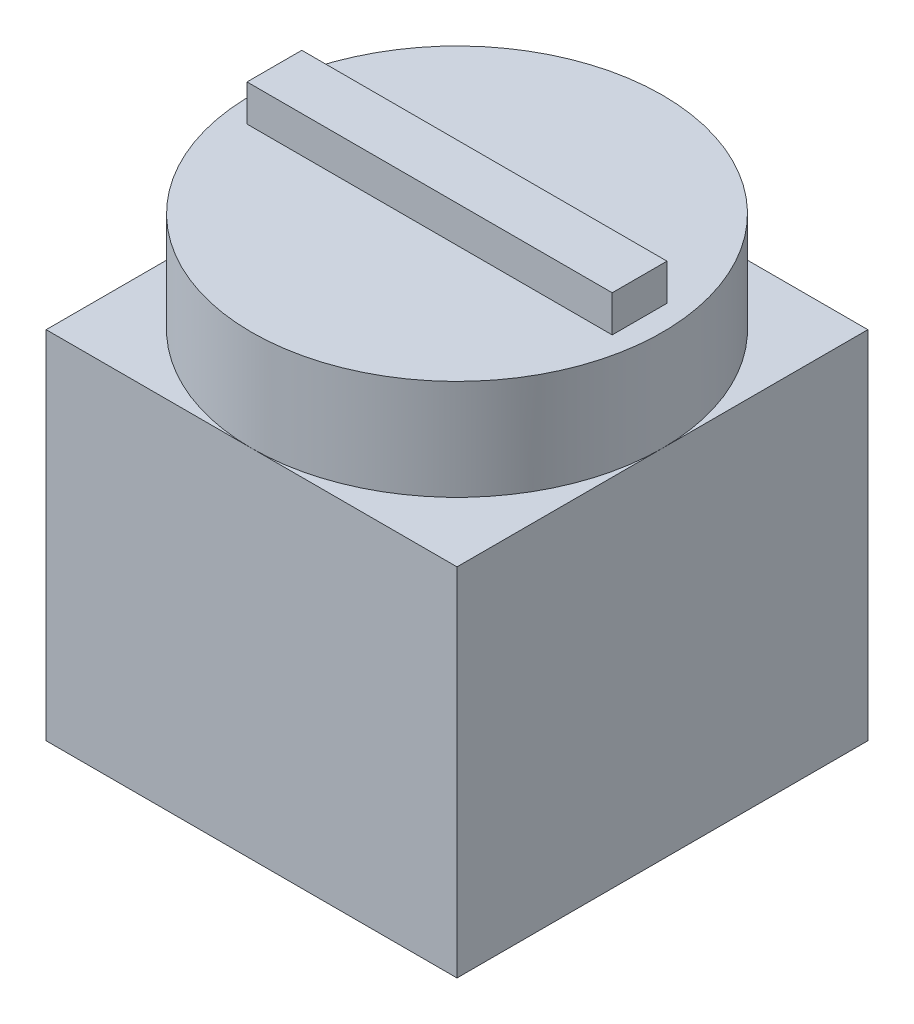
from build123d import *

# Parameters (mm, degrees)
ESQUISSE1_W        = 9
ESQUISSE1_H        = 9
BOSS_EXTRU_1_DEPTH = 7.8
ESQUISSE2_R        = 4.5
BOSS_EXTRU_2_DEPTH = 2.2
ESQUISSE3_W        = 3.4
ESQUISSE3_H        = 1.2
ESQUISSE3_W_2      = 1.2
BOSS_EXTRU_3_DEPTH = 0.8


with BuildPart() as part:
    # Esquisse1 → Boss.-Extru.1 (new body)
    with BuildSketch(Plane(origin=(0, 0, 0), x_dir=(1, 0, 0), z_dir=(0, 1, 0))):
        Rectangle(ESQUISSE1_W, ESQUISSE1_H)
    extrude(amount=BOSS_EXTRU_1_DEPTH)

    # Esquisse2 → Boss.-Extru.2 (add)
    with BuildSketch(Plane(origin=(0, 7.8, 0), x_dir=(1, 0, 0), z_dir=(0, 1, 0))):
        with Locations(Location((0, 0, 0), (0, 0, 270))):
            Circle(ESQUISSE2_R)
    extrude(amount=BOSS_EXTRU_2_DEPTH)

    # Esquisse3 → Boss.-Extru.3 (add)
    with BuildSketch(Plane(origin=(0, 10, 0), x_dir=(1, 0, 0), z_dir=(0, 1, 0))):
        with Locations((-2.3, 0)):
            Rectangle(ESQUISSE3_W, ESQUISSE3_H)
        Rectangle(ESQUISSE3_W_2, ESQUISSE3_H)
        with Locations((2.3, 0)):
            Rectangle(ESQUISSE3_W, ESQUISSE3_H)
    extrude(amount=BOSS_EXTRU_3_DEPTH)


solid = part.part
